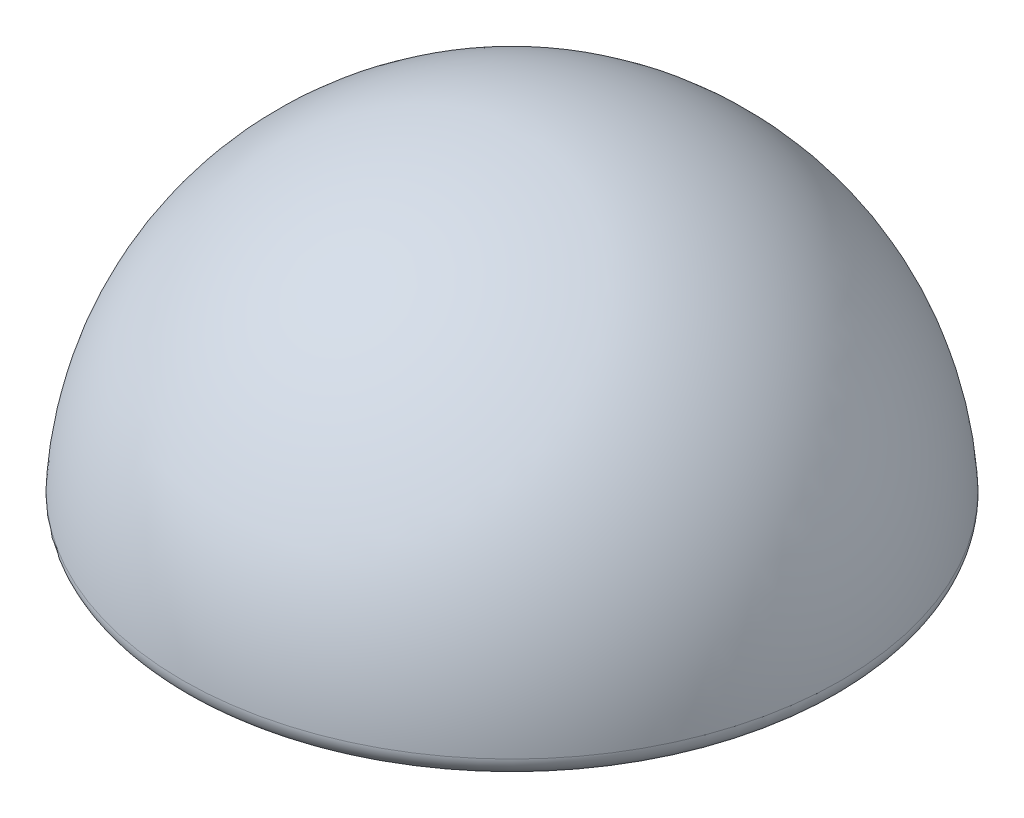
ISO-10303-21;
HEADER;
FILE_DESCRIPTION(('STEP AP214'),'2;1');
FILE_NAME('part.step','',(''),(''),'','','');
FILE_SCHEMA(('AUTOMOTIVE_DESIGN { 1 0 10303 214 1 1 1 1 }'));
ENDSEC;
DATA;
#1=APPLICATION_CONTEXT('core data for automotive mechanical design processes');
#2=APPLICATION_PROTOCOL_DEFINITION('international standard','automotive_design',2000,#1);
#3=PRODUCT_CONTEXT('',#1,'mechanical');
#4=PRODUCT('Part','Part','',(#3));
#5=PRODUCT_RELATED_PRODUCT_CATEGORY('part','',(#4));
#6=PRODUCT_DEFINITION_FORMATION('','',#4);
#7=PRODUCT_DEFINITION_CONTEXT('part definition',#1,'design');
#8=PRODUCT_DEFINITION('design','',#6,#7);
#9=PRODUCT_DEFINITION_SHAPE('','',#8);
#10=(LENGTH_UNIT() NAMED_UNIT(*) SI_UNIT(.MILLI.,.METRE.));
#11=(NAMED_UNIT(*) PLANE_ANGLE_UNIT() SI_UNIT($,.RADIAN.));
#12=(NAMED_UNIT(*) SI_UNIT($,.STERADIAN.) SOLID_ANGLE_UNIT());
#13=UNCERTAINTY_MEASURE_WITH_UNIT(LENGTH_MEASURE(1.E-05),#10,'distance_accuracy_value','');
#14=(GEOMETRIC_REPRESENTATION_CONTEXT(3) GLOBAL_UNCERTAINTY_ASSIGNED_CONTEXT((#13)) GLOBAL_UNIT_ASSIGNED_CONTEXT((#10,
#11,#12)) REPRESENTATION_CONTEXT('',''));
#15=CARTESIAN_POINT('',(0.,0.,0.));
#16=DIRECTION('',(0.,0.,1.));
#17=DIRECTION('',(1.,0.,0.));
#18=AXIS2_PLACEMENT_3D('',#15,#16,#17);
#19=CARTESIAN_POINT('',(0.,0.,0.));
#20=DIRECTION('',(0.,-1.,0.));
#21=DIRECTION('',(0.,0.,-1.));
#22=AXIS2_PLACEMENT_3D('',#19,#20,#21);
#23=PLANE('',#22);
#24=CARTESIAN_POINT('',(0.,0.,0.));
#25=DIRECTION('',(0.,-1.,0.));
#26=DIRECTION('',(0.,0.,-1.));
#27=AXIS2_PLACEMENT_3D('',#24,#25,#26);
#28=CIRCLE('',#27,32.9393381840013);
#29=CARTESIAN_POINT('',(0.,0.,-32.9393381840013));
#30=VERTEX_POINT('',#29);
#31=EDGE_CURVE('E37',#30,#30,#28,.T.);
#32=ORIENTED_EDGE('',*,*,#31,.T.);
#33=EDGE_LOOP('',(#32));
#34=FACE_BOUND('',#33,.T.);
#35=CARTESIAN_POINT('',(0.,0.,0.));
#36=DIRECTION('',(0.,-1.,0.));
#37=DIRECTION('',(0.,0.,-1.));
#38=AXIS2_PLACEMENT_3D('',#35,#36,#37);
#39=CIRCLE('',#38,12.25);
#40=CARTESIAN_POINT('',(0.,0.,-12.25));
#41=VERTEX_POINT('',#40);
#42=EDGE_CURVE('E45',#41,#41,#39,.T.);
#43=ORIENTED_EDGE('',*,*,#42,.F.);
#44=EDGE_LOOP('',(#43));
#45=FACE_BOUND('',#44,.T.);
#46=ADVANCED_FACE('F30',(#34,#45),#23,.T.);
#47=CARTESIAN_POINT('',(0.,0.,0.));
#48=DIRECTION('',(0.,-1.,0.));
#49=DIRECTION('',(1.,0.,0.));
#50=AXIS2_PLACEMENT_3D('',#47,#48,#49);
#51=SPHERICAL_SURFACE('',#50,35.);
#52=CARTESIAN_POINT('',(0.,2.12121212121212,0.));
#53=DIRECTION('',(0.,-1.,0.));
#54=DIRECTION('',(0.,0.,-1.));
#55=AXIS2_PLACEMENT_3D('',#52,#53,#54);
#56=CIRCLE('',#55,34.9356617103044);
#57=CARTESIAN_POINT('',(0.,2.12121212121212,-34.9356617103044));
#58=VERTEX_POINT('',#57);
#59=EDGE_CURVE('E10',#58,#58,#56,.F.);
#60=ORIENTED_EDGE('',*,*,#59,.T.);
#61=EDGE_LOOP('',(#60));
#62=FACE_BOUND('',#61,.T.);
#63=ADVANCED_FACE('F54',(#62),#51,.T.);
#64=CARTESIAN_POINT('',(0.,16.,0.));
#65=DIRECTION('',(0.,-1.,0.));
#66=DIRECTION('',(0.,0.,-1.));
#67=AXIS2_PLACEMENT_3D('',#64,#65,#66);
#68=CYLINDRICAL_SURFACE('',#67,12.25);
#69=CARTESIAN_POINT('',(0.,16.,0.));
#70=DIRECTION('',(0.,-1.,0.));
#71=DIRECTION('',(0.,0.,-1.));
#72=AXIS2_PLACEMENT_3D('',#69,#70,#71);
#73=CIRCLE('',#72,12.25);
#74=CARTESIAN_POINT('',(0.,16.,-12.25));
#75=VERTEX_POINT('',#74);
#76=EDGE_CURVE('E41',#75,#75,#73,.T.);
#77=ORIENTED_EDGE('',*,*,#76,.F.);
#78=EDGE_LOOP('',(#77));
#79=FACE_BOUND('',#78,.T.);
#80=ORIENTED_EDGE('',*,*,#42,.T.);
#81=EDGE_LOOP('',(#80));
#82=FACE_BOUND('',#81,.T.);
#83=ADVANCED_FACE('F51',(#79,#82),#68,.F.);
#84=CARTESIAN_POINT('',(0.,16.,0.));
#85=DIRECTION('',(0.,-1.,0.));
#86=DIRECTION('',(0.,0.,-1.));
#87=AXIS2_PLACEMENT_3D('',#84,#85,#86);
#88=PLANE('',#87);
#89=ORIENTED_EDGE('',*,*,#76,.T.);
#90=EDGE_LOOP('',(#89));
#91=FACE_BOUND('',#90,.T.);
#92=ADVANCED_FACE('F62',(#91),#88,.T.);
#93=CARTESIAN_POINT('',(0.,2.,0.));
#94=DIRECTION('',(0.,-1.,0.));
#95=DIRECTION('',(0.,0.,-1.));
#96=AXIS2_PLACEMENT_3D('',#93,#94,#95);
#97=TOROIDAL_SURFACE('',#96,32.9393381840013,2.);
#98=ORIENTED_EDGE('',*,*,#59,.F.);
#99=EDGE_LOOP('',(#98));
#100=FACE_BOUND('',#99,.T.);
#101=ORIENTED_EDGE('',*,*,#31,.F.);
#102=EDGE_LOOP('',(#101));
#103=FACE_BOUND('',#102,.T.);
#104=ADVANCED_FACE('F32',(#100,#103),#97,.T.);
#105=CLOSED_SHELL('',(#46,#63,#83,#92,#104));
#106=MANIFOLD_SOLID_BREP('B2',#105);
#107=ADVANCED_BREP_SHAPE_REPRESENTATION('',(#18,#106),#14);
#108=SHAPE_DEFINITION_REPRESENTATION(#9,#107);
ENDSEC;
END-ISO-10303-21;
